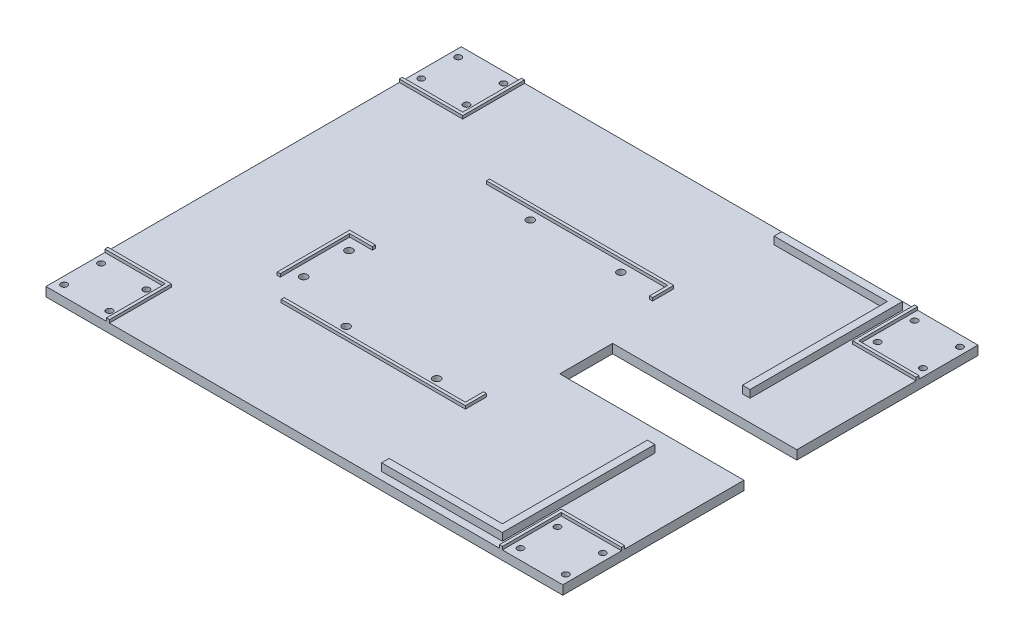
from build123d import *

# Parameters (mm, degrees)
SKETCH2_W           = 340
SKETCH2_H           = 275
SKETCH2_R           = 2.1
BOSS_EXTRUDE1_DEPTH = 6
SKETCH5_W           = 1.21728397
SKETCH5_H           = 275
SKETCH5_W_2         = 1.12
BOSS_EXTRUDE3_DEPTH = 6
SKETCH7_W           = 200
SKETCH7_H           = 100
CUT_EXTRUDE1_DEPTH  = 10
SKETCH8_R           = 2.5
CUT_EXTRUDE2_DEPTH  = 7
SKETCH9_R           = 2.5
CUT_EXTRUDE3_DEPTH  = 10
SKETCH10_W          = 122
SKETCH10_H          = 32.5
BOSS_EXTRUDE4_DEPTH = 6
SKETCH11_W          = 122
SKETCH11_H          = 35
CUT_EXTRUDE4_DEPTH  = 6
BOSS_EXTRUDE5_DEPTH = 5
BOSS_EXTRUDE6_DEPTH = 2
BOSS_EXTRUDE7_DEPTH = 2
BOSS_EXTRUDE8_DEPTH = 2


with BuildPart() as part:
    # Sketch2 → Boss-Extrude1 (new body)
    with BuildSketch(Plane(origin=(0, 0, 0), x_dir=(1, 0, 0), z_dir=(0, 1, 0))):
        Rectangle(SKETCH2_W, SKETCH2_H)
        with Locations(Location((-166.12, 130.5, 0), (0, 0, 270))):
            Circle(SKETCH2_R, mode=Mode.SUBTRACT)
        with Locations(Location((-136.12, 130.5, 0), (0, 0, 270))):
            Circle(SKETCH2_R, mode=Mode.SUBTRACT)
        with Locations(Location((-136.12, 106, 0), (0, 0, 270))):
            Circle(SKETCH2_R, mode=Mode.SUBTRACT)
        with Locations(Location((-166.12, 106, 0), (0, 0, 270))):
            Circle(SKETCH2_R, mode=Mode.SUBTRACT)
        with Locations(Location((166.12, -130.5, 0), (0, 0, 270))):
            Circle(SKETCH2_R, mode=Mode.SUBTRACT)
        with Locations(Location((166.12, -106, 0), (0, 0, 270))):
            Circle(SKETCH2_R, mode=Mode.SUBTRACT)
        with Locations(Location((136.12, -106, 0), (0, 0, 270))):
            Circle(SKETCH2_R, mode=Mode.SUBTRACT)
        with Locations(Location((136.12, -130.5, 0), (0, 0, 270))):
            Circle(SKETCH2_R, mode=Mode.SUBTRACT)
        with Locations(Location((-136.12, -130.5, 0), (0, 0, 270))):
            Circle(SKETCH2_R, mode=Mode.SUBTRACT)
        with Locations(Location((-136.12, -106, 0), (0, 0, 270))):
            Circle(SKETCH2_R, mode=Mode.SUBTRACT)
        with Locations(Location((-166.12, -130.5, 0), (0, 0, 270))):
            Circle(SKETCH2_R, mode=Mode.SUBTRACT)
        with Locations(Location((-166.12, -106, 0), (0, 0, 270))):
            Circle(SKETCH2_R, mode=Mode.SUBTRACT)
        with Locations(Location((166.12, 106, 0), (0, 0, 270))):
            Circle(SKETCH2_R, mode=Mode.SUBTRACT)
        with Locations(Location((166.12, 130.5, 0), (0, 0, 270))):
            Circle(SKETCH2_R, mode=Mode.SUBTRACT)
        with Locations(Location((136.12, 130.5, 0), (0, 0, 270))):
            Circle(SKETCH2_R, mode=Mode.SUBTRACT)
        with Locations(Location((136.12, 106, 0), (0, 0, 270))):
            Circle(SKETCH2_R, mode=Mode.SUBTRACT)
    extrude(amount=BOSS_EXTRUDE1_DEPTH)

    # Sketch5 → Boss-Extrude3 (add)
    with BuildSketch(Plane(origin=(0, 6, 0), x_dir=(1, 0, 0), z_dir=(0, 1, 0))):
        with Locations((169.391358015, 0)):
            Rectangle(SKETCH5_W, SKETCH5_H)
        with Locations((170.56, 0)):
            Rectangle(SKETCH5_W_2, SKETCH5_H)
        with Locations((-169.391358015, 0)):
            Rectangle(SKETCH5_W, SKETCH5_H)
        with Locations((-170.56, 0)):
            Rectangle(SKETCH5_W_2, SKETCH5_H)
    extrude(amount=-BOSS_EXTRUDE3_DEPTH)

    # Sketch7 → Cut-Extrude1 (cut)
    with BuildSketch(Plane(origin=(0, 6, 0), x_dir=(1, 0, 0), z_dir=(0, 1, 0))):
        with Locations((171.12, 0)):
            Rectangle(SKETCH7_W, SKETCH7_H)
    extrude(amount=-CUT_EXTRUDE1_DEPTH, mode=Mode.SUBTRACT)

    # Sketch8 → Cut-Extrude2 (cut)
    with BuildSketch(Plane(origin=(0, 6, 0), x_dir=(1, 0, 0), z_dir=(0, 1, 0))):
        with Locations(Location((11.12, 61, 0), (0, 0, 270))):
            Circle(SKETCH8_R)
        with Locations(Location((-48.88, 61, 0), (0, 0, 270))):
            Circle(SKETCH8_R)
        with Locations(Location((11.12, -61, 0), (0, 0, 270))):
            Circle(SKETCH8_R)
        with Locations(Location((-48.88, -61, 0), (0, 0, 270))):
            Circle(SKETCH8_R)
    extrude(amount=-CUT_EXTRUDE2_DEPTH, mode=Mode.SUBTRACT)

    # Sketch9 → Cut-Extrude3 (cut)
    with BuildSketch(Plane(origin=(0, 6, 0), x_dir=(1, 0, 0), z_dir=(0, 1, 0))):
        with Locations(Location((-91.38, -46.6, 0), (0, 0, 270))):
            Circle(SKETCH9_R)
        with Locations(Location((-91.38, -16.6, 0), (0, 0, 270))):
            Circle(SKETCH9_R)
    extrude(amount=-CUT_EXTRUDE3_DEPTH, mode=Mode.SUBTRACT)

    # Sketch10 → Boss-Extrude4 (add)
    with BuildSketch(Plane(origin=(0, 6, 0), x_dir=(1, 0, 0), z_dir=(0, 1, 0))):
        with Locations((110.12, 33.75)):
            Rectangle(SKETCH10_W, SKETCH10_H)
        with Locations((110.12, -33.75)):
            Rectangle(SKETCH10_W, SKETCH10_H)
    extrude(amount=-BOSS_EXTRUDE4_DEPTH)

    # Sketch11 → Cut-Extrude4 (cut)
    with BuildSketch(Plane(origin=(0, 6, 0), x_dir=(1, 0, 0), z_dir=(0, 1, 0))):
        with Locations((110.12, 0)):
            Rectangle(SKETCH11_W, SKETCH11_H)
    extrude(amount=-CUT_EXTRUDE4_DEPTH, mode=Mode.SUBTRACT)

    # Sketch12 → Boss-Extrude5 (add)
    with BuildSketch(Plane(origin=(0, 6, 0), x_dir=(1, 0, 0), z_dir=(0, 1, 0))):
        Polygon((121.12, -127.5), (46.12, -127.5), (46.12, -132.5), (126.12, -132.5), (126.12, -31.5), (121.12, -31.5), align=None)
        Polygon((126.12, 132.5), (126.12, 31.5), (121.12, 31.5), (121.12, 127.5), (46.12, 127.5), (46.12, 132.5), align=None)
    extrude(amount=BOSS_EXTRUDE5_DEPTH)

    # Sketch14 → Boss-Extrude6 (add)
    with BuildSketch(Plane(origin=(0, 6, 0), x_dir=(1, 0, 0), z_dir=(0, 1, 0))):
        Polygon((-98.88, -8.6), (-98.88, -54.6), (-100.88, -54.6), (-100.88, -6.6), (-83.88, -6.6), (-83.88, -8.6), align=None)
    extrude(amount=BOSS_EXTRUDE6_DEPTH)

    # Sketch15 → Boss-Extrude7 (add)
    with BuildSketch(Plane(origin=(0, 6, 0), x_dir=(1, 0, 0), z_dir=(0, 1, 0))):
        Polygon((-131.12, 137.5), (-131.12, 98.5), (-171.12, 98.5), (-171.12, 96.5), (-129.12, 96.5), (-129.12, 137.5), align=None)
        Polygon((-171.12, -98.5), (-131.12, -98.5), (-131.12, -137.5), (-129.12, -137.5), (-129.12, -96.5), (-171.12, -96.5), align=None)
        Polygon((131.12, 98.5), (131.12, 137.5), (129.12, 137.5), (129.12, 96.5), (171.12, 96.5), (171.12, 98.5), align=None)
        Polygon((131.12, -137.5), (131.12, -98.5), (171.12, -98.5), (171.12, -96.5), (129.12, -96.5), (129.12, -137.5), align=None)
    extrude(amount=BOSS_EXTRUDE7_DEPTH)

    # Sketch16 → Boss-Extrude8 (add)
    with BuildSketch(Plane(origin=(0, 6, 0), x_dir=(1, 0, 0), z_dir=(0, 1, 0))):
        Polygon((-83.88, 67), (36.12, 67), (36.12, 55), (38.12, 55), (38.12, 69), (-83.88, 69), align=None)
        Polygon((-83.88, -67), (36.12, -67), (36.12, -55), (38.12, -55), (38.12, -69), (-83.88, -69), align=None)
    extrude(amount=BOSS_EXTRUDE8_DEPTH)


solid = part.part
